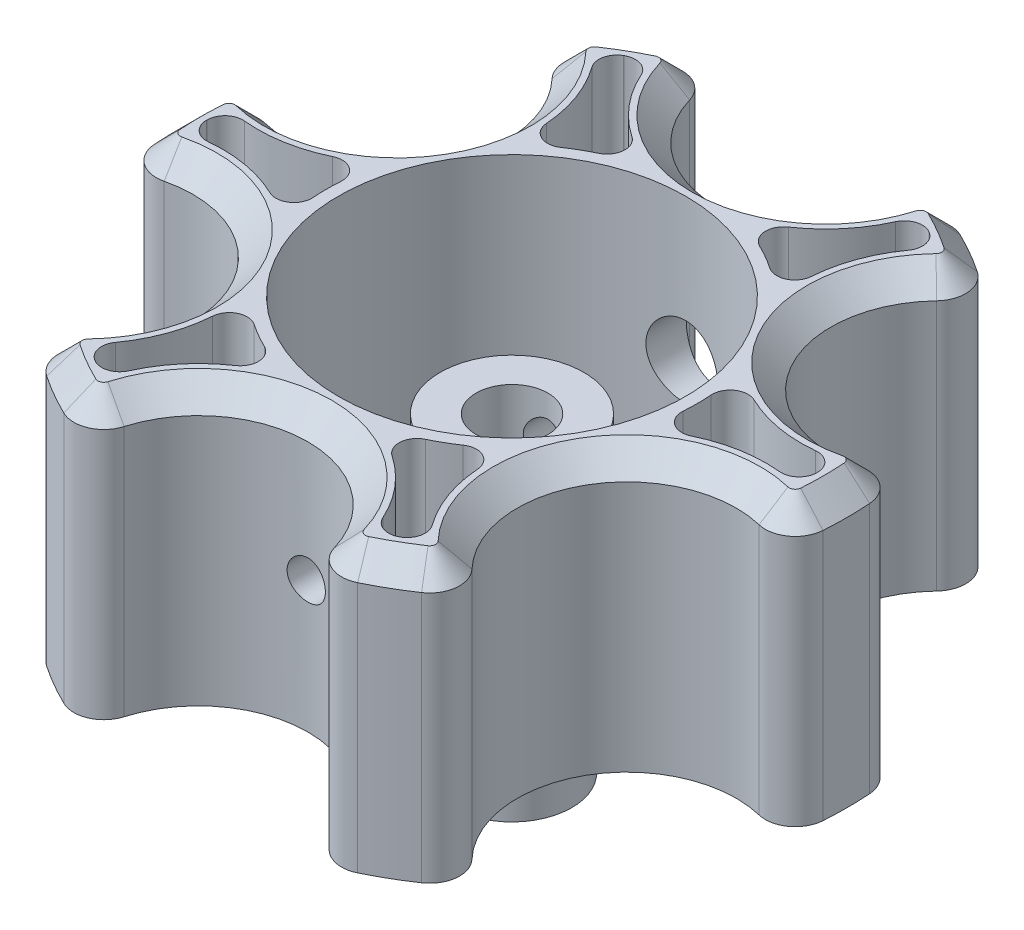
from build123d import *

# Parameters (mm, degrees)
EXTRUDE_1_DEPTH     = 23
FILLET_1_R          = 2.5
CHAMFER_1_SIZE      = 2
SKETCH_2_R          = 14.5
CUT_EXTRUDE_1_DEPTH = 21
SKETCH_3_R          = 6
SKETCH_3_R_2        = 3
EXTRUDE_2_DEPTH     = 13.5
SKETCH_4_R          = 1.6
CUT_EXTRUDE_2_DEPTH = 12
SKETCH_5_R          = 1.25
CUT_EXTRUDE_3_DEPTH = 25
CUT_EXTRUDE_START   = -10
SKETCH_6_R          = 3
CUT_EXTRUDE_4_DEPTH = 50
EXTRUDE_START       = 11.5
SKETCH_7_R          = 5
SKETCH_7_R_2        = 3
EXTRUDE_3_DEPTH     = 11.5
EXTRUDE_START_2     = 1
SKETCH_8_R          = 6
SKETCH_8_R_2        = 5
EXTRUDE_4_DEPTH     = 1
CUT_EXTRUDE_START_2 = -1
SKETCH_9_R          = 6
CUT_EXTRUDE_5_DEPTH = 1
SKETCH_12_R         = 1.6
CUT_EXTRUDE_7_DEPTH = 8
CUT_EXTRUDE_START_3 = 20
SKETCH_13_R         = 1.6
CUT_EXTRUDE_8_DEPTH = 8
CUT_EXTRUDE_9_DEPTH = 21.5
FILLET_4_R          = 1.5


with BuildPart() as part:
    # Sketch 1 → Extrude 1 (new body)
    with BuildSketch(Plane(origin=(0, 0, 0), x_dir=(1, 0, 0), z_dir=(0, 1, 0))):
        with BuildLine():
            ThreePointArc((-27.491655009, 5.311205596), (-28, 0), (-27.491655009, -5.311205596))
            ThreePointArc((-27.491655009, -5.311205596), (-14.765733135, -8.525), (-18.345466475, -21.152868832))
            ThreePointArc((-18.345466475, -21.152868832), (-14, -24.248711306), (-9.146188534, -26.464074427))
            ThreePointArc((-9.146188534, -26.464074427), (0, -17.05), (9.146188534, -26.464074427))
            ThreePointArc((9.146188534, -26.464074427), (14, -24.248711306), (18.345466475, -21.152868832))
            ThreePointArc((18.345466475, -21.152868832), (14.765733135, -8.525), (27.491655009, -5.311205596))
            ThreePointArc((27.491655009, -5.311205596), (28, 0), (27.491655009, 5.311205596))
            ThreePointArc((27.491655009, 5.311205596), (14.765733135, 8.525), (18.345466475, 21.152868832))
            ThreePointArc((18.345466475, 21.152868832), (14, 24.248711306), (9.146188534, 26.464074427))
            ThreePointArc((9.146188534, 26.464074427), (0, 17.05), (-9.146188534, 26.464074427))
            ThreePointArc((-9.146188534, 26.464074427), (-14, 24.248711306), (-18.345466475, 21.152868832))
            ThreePointArc((-18.345466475, 21.152868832), (-14.765733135, 8.525), (-27.491655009, 5.311205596))
        make_face()
    extrude(amount=EXTRUDE_1_DEPTH)

    # Fillet 1
    fillet_1_edges = [part.edges().sort_by_distance(p)[0] for p in [
        (27.491655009, 11.5, 5.311205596),
        (18.345466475, 11.5, 21.152868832),
        (9.146188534, 11.5, 26.464074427),
        (-9.146188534, 11.5, 26.464074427),
        (-18.345466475, 11.5, 21.152868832),
        (-27.491655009, 11.5, 5.311205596),
        (-27.491655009, 11.5, -5.311205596),
        (-18.345466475, 11.5, -21.152868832),
        (-9.146188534, 11.5, -26.464074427),
        (9.146188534, 11.5, -26.464074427),
        (18.345466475, 11.5, -21.152868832),
        (27.491655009, 11.5, -5.311205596),
    ]]
    fillet(fillet_1_edges, radius=FILLET_1_R)

    # Chamfer 1
    chamfer_1_edges = [part.edges().sort_by_distance(p)[0] for p in [
        (28, 23, 0),
        (14.765733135, 23, 8.525),
        (14.765733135, 23, -8.525),
        (14, 23, -24.248711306),
        (0, 23, -17.05),
        (-14, 23, -24.248711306),
        (-14.765733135, 23, -8.525),
        (-28, 23, 0),
        (-14.765733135, 23, 8.525),
        (-14, 23, 24.248711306),
        (0, 23, 17.05),
        (14, 23, 24.248711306),
        (-10.168776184, 23, 25.20624322),
        (-16.744858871, 23, 21.409540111),
        (26.913635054, 23, -3.79670311),
        (16.744858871, 23, -21.409540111),
        (10.168776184, 23, -25.20624322),
        (-10.168776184, 23, -25.20624322),
        (-16.744858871, 23, -21.409540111),
        (-26.913635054, 23, -3.79670311),
        (-26.913635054, 23, 3.79670311),
        (10.168776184, 23, 25.20624322),
        (16.744858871, 23, 21.409540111),
        (26.913635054, 23, 3.79670311),
    ]]
    chamfer(chamfer_1_edges, length=CHAMFER_1_SIZE)

    # Sketch 2 → Cut-Extrude 1 (cut)
    with BuildSketch(Plane(origin=(0, 23, 0), x_dir=(1, 0, 0), z_dir=(0, 1, 0))):
        with Locations(Location((0, 0, 0), (0, 0, 270))):
            Circle(SKETCH_2_R)
    extrude(amount=-CUT_EXTRUDE_1_DEPTH, mode=Mode.SUBTRACT)

    # Sketch 3 → Extrude 2 (add)
    with BuildSketch(Plane(origin=(0, 2, 0), x_dir=(1, 0, 0), z_dir=(0, 1, 0))):
        with Locations(Location((0, 0, 0), (0, 0, 270))):
            Circle(SKETCH_3_R)
        with Locations(Location((0, 0, 0), (0, 0, 270))):
            Circle(SKETCH_3_R_2, mode=Mode.SUBTRACT)
    extrude(amount=EXTRUDE_2_DEPTH)

    # Sketch 4 → Cut-Extrude 2 (cut)
    with BuildSketch(Plane.XZ):
        with Locations(Location((0, 0, 0), (0, 0, 270))):
            Circle(SKETCH_4_R)
    extrude(amount=-CUT_EXTRUDE_2_DEPTH, mode=Mode.SUBTRACT)

    # Sketch 5 → Cut-Extrude 3 (cut, symmetric)
    with BuildSketch(Plane.XY):
        with Locations((0, 11)):
            Circle(SKETCH_5_R)
    extrude(amount=CUT_EXTRUDE_3_DEPTH, both=True, mode=Mode.SUBTRACT)

    # Sketch 6 → Cut-Extrude 4 (cut)
    with BuildSketch(Plane.XY.offset(CUT_EXTRUDE_START)):
        with Locations((0, 11)):
            Circle(SKETCH_6_R)
    extrude(amount=-CUT_EXTRUDE_4_DEPTH, mode=Mode.SUBTRACT)

    # Sketch 7 → Extrude 3 (add)
    with BuildSketch(Plane.XZ.offset(EXTRUDE_START)):
        with Locations(Location((0, 0, 0), (0, 0, 90))):
            Circle(SKETCH_7_R)
        with Locations(Location((0, 0, 0), (0, 0, 90))):
            Circle(SKETCH_7_R_2, mode=Mode.SUBTRACT)
    extrude(amount=-EXTRUDE_3_DEPTH)

    # Sketch 8 → Extrude 4 (add)
    with BuildSketch(Plane.XZ.offset(EXTRUDE_START_2)):
        with Locations(Location((0, 0, 0), (0, 0, 90))):
            Circle(SKETCH_8_R)
        with Locations(Location((0, 0, 0), (0, 0, 270))):
            Circle(SKETCH_8_R_2, mode=Mode.SUBTRACT)
    extrude(amount=-EXTRUDE_4_DEPTH)

    # Sketch 9 → Cut-Extrude 5 (cut)
    with BuildSketch(Plane(origin=(0, 15.5, 0), x_dir=(1, 0, 0), z_dir=(0, 1, 0)).offset(CUT_EXTRUDE_START_2)):
        with Locations(Location((0, 0, 0), (0, 0, 270))):
            Circle(SKETCH_9_R)
    extrude(amount=CUT_EXTRUDE_5_DEPTH, mode=Mode.SUBTRACT)

    # Sketch 12 → Cut-Extrude 7 (cut)
    with BuildSketch(Plane.XY):
        with Locations(Location((0, 11, 0), (0, 0, 90))):
            Circle(SKETCH_12_R)
    extrude(amount=-CUT_EXTRUDE_7_DEPTH, mode=Mode.SUBTRACT)

    # Sketch 13 → Cut-Extrude 8 (cut)
    with BuildSketch(Plane.XY.offset(CUT_EXTRUDE_START_3)):
        with Locations(Location((0, 11, 0), (0, 0, 90))):
            Circle(SKETCH_13_R)
    extrude(amount=-CUT_EXTRUDE_8_DEPTH, mode=Mode.SUBTRACT)

    # Sketch 14 → Cut-Extrude 9 (cut)
    with BuildSketch(Plane(origin=(0, 23, 0), x_dir=(1, 0, 0), z_dir=(0, 1, 0))):
        with BuildLine():
            ThreePointArc((15.5, 0), (15.33233072, -2.273683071), (14.83295036, -4.498175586))
            ThreePointArc((14.83295036, -4.498175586), (19.796074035, -1.815122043), (25.437886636, -1.778742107))
            ThreePointArc((25.437886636, -1.778742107), (25.5, 0), (25.437886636, 1.778742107))
            ThreePointArc((25.437886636, 1.778742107), (19.796074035, 1.815122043), (14.83295036, 4.498175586))
            ThreePointArc((14.83295036, 4.498175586), (15.33233072, 2.273683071), (15.5, 0))
        make_face()
        with BuildLine():
            ThreePointArc((3.520940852, 15.094799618), (7.75, 13.423393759), (11.312009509, 10.596624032))
            ThreePointArc((11.312009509, 10.596624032), (11.469978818, 16.236341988), (14.25937917, 21.140484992))
            ThreePointArc((14.25937917, 21.140484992), (12.75, 22.083647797), (11.178507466, 22.919227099))
            ThreePointArc((11.178507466, 22.919227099), (8.326095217, 18.051464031), (3.520940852, 15.094799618))
        make_face()
        with BuildLine():
            ThreePointArc((-14.25937917, 21.140484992), (-11.469978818, 16.236341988), (-11.312009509, 10.596624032))
            ThreePointArc((-11.312009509, 10.596624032), (-7.75, 13.423393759), (-3.520940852, 15.094799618))
            ThreePointArc((-3.520940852, 15.094799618), (-8.326095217, 18.051464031), (-11.178507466, 22.919227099))
            ThreePointArc((-11.178507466, 22.919227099), (-12.75, 22.083647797), (-14.25937917, 21.140484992))
        make_face()
        with BuildLine():
            ThreePointArc((-25.437886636, -1.778742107), (-19.796074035, -1.815122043), (-14.83295036, -4.498175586))
            ThreePointArc((-14.83295036, -4.498175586), (-15.5, 0), (-14.83295036, 4.498175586))
            ThreePointArc((-14.83295036, 4.498175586), (-19.796074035, 1.815122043), (-25.437886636, 1.778742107))
            ThreePointArc((-25.437886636, 1.778742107), (-25.5, 0), (-25.437886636, -1.778742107))
        make_face()
        with BuildLine():
            ThreePointArc((-11.178507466, -22.919227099), (-8.326095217, -18.051464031), (-3.520940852, -15.094799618))
            ThreePointArc((-3.520940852, -15.094799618), (-7.75, -13.423393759), (-11.312009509, -10.596624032))
            ThreePointArc((-11.312009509, -10.596624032), (-11.469978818, -16.236341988), (-14.25937917, -21.140484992))
            ThreePointArc((-14.25937917, -21.140484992), (-12.75, -22.083647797), (-11.178507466, -22.919227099))
        make_face()
        with BuildLine():
            ThreePointArc((3.520940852, -15.094799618), (8.326095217, -18.051464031), (11.178507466, -22.919227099))
            ThreePointArc((11.178507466, -22.919227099), (12.75, -22.083647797), (14.25937917, -21.140484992))
            ThreePointArc((14.25937917, -21.140484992), (11.469978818, -16.236341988), (11.312009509, -10.596624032))
            ThreePointArc((11.312009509, -10.596624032), (7.75, -13.423393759), (3.520940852, -15.094799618))
        make_face()
    extrude(amount=-CUT_EXTRUDE_9_DEPTH, mode=Mode.SUBTRACT)

    # Fillet 4
    fillet_4_edges = [part.edges().sort_by_distance(p)[0] for p in [
        (25.437886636, 12.25, 1.778742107),
        (25.437886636, 12.25, -1.778742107),
        (14.83295036, 12.25, -4.498175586),
        (14.83295036, 12.25, 4.498175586),
        (14.25937917, 12.25, -21.140484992),
        (11.178507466, 12.25, -22.919227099),
        (3.520940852, 12.25, -15.094799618),
        (11.312009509, 12.25, -10.596624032),
        (-11.178507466, 12.25, -22.919227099),
        (-14.25937917, 12.25, -21.140484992),
        (-11.312009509, 12.25, -10.596624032),
        (-3.520940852, 12.25, -15.094799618),
        (-25.437886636, 12.25, -1.778742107),
        (-25.437886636, 12.25, 1.778742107),
        (-14.83295036, 12.25, 4.498175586),
        (-14.83295036, 12.25, -4.498175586),
        (-14.25937917, 12.25, 21.140484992),
        (-11.178507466, 12.25, 22.919227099),
        (-3.520940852, 12.25, 15.094799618),
        (-11.312009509, 12.25, 10.596624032),
        (11.178507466, 12.25, 22.919227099),
        (14.25937917, 12.25, 21.140484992),
        (11.312009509, 12.25, 10.596624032),
        (3.520940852, 12.25, 15.094799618),
    ]]
    fillet(fillet_4_edges, radius=FILLET_4_R)


solid = part.part
